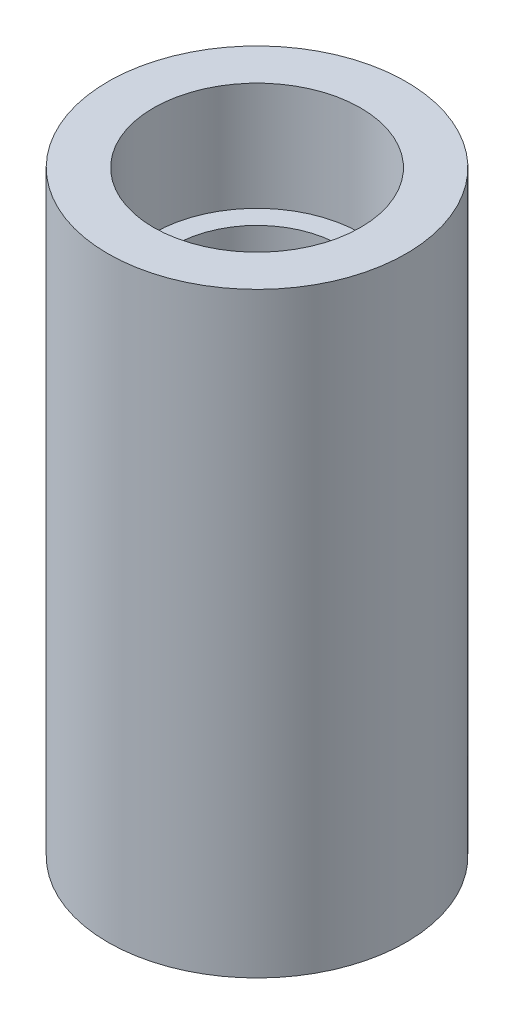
ISO-10303-21;
HEADER;
FILE_DESCRIPTION(('STEP AP214'),'2;1');
FILE_NAME('part.step','',(''),(''),'','','');
FILE_SCHEMA(('AUTOMOTIVE_DESIGN { 1 0 10303 214 1 1 1 1 }'));
ENDSEC;
DATA;
#1=APPLICATION_CONTEXT('core data for automotive mechanical design processes');
#2=APPLICATION_PROTOCOL_DEFINITION('international standard','automotive_design',2000,#1);
#3=PRODUCT_CONTEXT('',#1,'mechanical');
#4=PRODUCT('Part','Part','',(#3));
#5=PRODUCT_RELATED_PRODUCT_CATEGORY('part','',(#4));
#6=PRODUCT_DEFINITION_FORMATION('','',#4);
#7=PRODUCT_DEFINITION_CONTEXT('part definition',#1,'design');
#8=PRODUCT_DEFINITION('design','',#6,#7);
#9=PRODUCT_DEFINITION_SHAPE('','',#8);
#10=(LENGTH_UNIT() NAMED_UNIT(*) SI_UNIT(.MILLI.,.METRE.));
#11=(NAMED_UNIT(*) PLANE_ANGLE_UNIT() SI_UNIT($,.RADIAN.));
#12=(NAMED_UNIT(*) SI_UNIT($,.STERADIAN.) SOLID_ANGLE_UNIT());
#13=UNCERTAINTY_MEASURE_WITH_UNIT(LENGTH_MEASURE(1.E-05),#10,'distance_accuracy_value','');
#14=(GEOMETRIC_REPRESENTATION_CONTEXT(3) GLOBAL_UNCERTAINTY_ASSIGNED_CONTEXT((#13)) GLOBAL_UNIT_ASSIGNED_CONTEXT((#10,
#11,#12)) REPRESENTATION_CONTEXT('',''));
#15=CARTESIAN_POINT('',(0.,0.,0.));
#16=DIRECTION('',(0.,0.,1.));
#17=DIRECTION('',(1.,0.,0.));
#18=AXIS2_PLACEMENT_3D('',#15,#16,#17);
#19=CARTESIAN_POINT('',(0.,27.94,0.));
#20=DIRECTION('',(0.,-1.,0.));
#21=DIRECTION('',(0.,0.,-1.));
#22=AXIS2_PLACEMENT_3D('',#19,#20,#21);
#23=CYLINDRICAL_SURFACE('',#22,6.985);
#24=CARTESIAN_POINT('',(0.,27.94,0.));
#25=DIRECTION('',(0.,1.,0.));
#26=DIRECTION('',(0.,0.,1.));
#27=AXIS2_PLACEMENT_3D('',#24,#25,#26);
#28=CIRCLE('',#27,6.985);
#29=CARTESIAN_POINT('',(0.,27.94,6.985));
#30=VERTEX_POINT('',#29);
#31=EDGE_CURVE('E10',#30,#30,#28,.T.);
#32=ORIENTED_EDGE('',*,*,#31,.F.);
#33=EDGE_LOOP('',(#32));
#34=FACE_BOUND('',#33,.T.);
#35=CARTESIAN_POINT('',(0.,0.,0.));
#36=DIRECTION('',(0.,1.,0.));
#37=DIRECTION('',(0.,0.,1.));
#38=AXIS2_PLACEMENT_3D('',#35,#36,#37);
#39=CIRCLE('',#38,6.985);
#40=CARTESIAN_POINT('',(0.,0.,6.985));
#41=VERTEX_POINT('',#40);
#42=EDGE_CURVE('E33',#41,#41,#39,.T.);
#43=ORIENTED_EDGE('',*,*,#42,.T.);
#44=EDGE_LOOP('',(#43));
#45=FACE_BOUND('',#44,.T.);
#46=ADVANCED_FACE('F30',(#34,#45),#23,.T.);
#47=CARTESIAN_POINT('',(0.,27.94,0.));
#48=DIRECTION('',(0.,1.,0.));
#49=DIRECTION('',(0.,0.,1.));
#50=AXIS2_PLACEMENT_3D('',#47,#48,#49);
#51=PLANE('',#50);
#52=CARTESIAN_POINT('',(0.,27.94,0.));
#53=DIRECTION('',(0.,1.,0.));
#54=DIRECTION('',(0.,0.,1.));
#55=AXIS2_PLACEMENT_3D('',#52,#53,#54);
#56=CIRCLE('',#55,4.8514);
#57=CARTESIAN_POINT('',(0.,27.94,4.8514));
#58=VERTEX_POINT('',#57);
#59=EDGE_CURVE('E42',#58,#58,#56,.T.);
#60=ORIENTED_EDGE('',*,*,#59,.F.);
#61=EDGE_LOOP('',(#60));
#62=FACE_BOUND('',#61,.T.);
#63=ORIENTED_EDGE('',*,*,#31,.T.);
#64=EDGE_LOOP('',(#63));
#65=FACE_BOUND('',#64,.T.);
#66=ADVANCED_FACE('F73',(#62,#65),#51,.T.);
#67=CARTESIAN_POINT('',(0.,0.,0.));
#68=DIRECTION('',(0.,1.,0.));
#69=DIRECTION('',(0.,0.,1.));
#70=AXIS2_PLACEMENT_3D('',#67,#68,#69);
#71=PLANE('',#70);
#72=CARTESIAN_POINT('',(0.,0.,0.));
#73=DIRECTION('',(0.,-1.,0.));
#74=DIRECTION('',(0.,0.,-1.));
#75=AXIS2_PLACEMENT_3D('',#72,#73,#74);
#76=CIRCLE('',#75,4.7625);
#77=CARTESIAN_POINT('',(0.,0.,-4.7625));
#78=VERTEX_POINT('',#77);
#79=EDGE_CURVE('E54',#78,#78,#76,.T.);
#80=ORIENTED_EDGE('',*,*,#79,.F.);
#81=EDGE_LOOP('',(#80));
#82=FACE_BOUND('',#81,.T.);
#83=ORIENTED_EDGE('',*,*,#42,.F.);
#84=EDGE_LOOP('',(#83));
#85=FACE_BOUND('',#84,.T.);
#86=ADVANCED_FACE('F69',(#82,#85),#71,.F.);
#87=CARTESIAN_POINT('',(0.,22.86,0.));
#88=DIRECTION('',(0.,1.,0.));
#89=DIRECTION('',(0.,0.,1.));
#90=AXIS2_PLACEMENT_3D('',#87,#88,#89);
#91=CYLINDRICAL_SURFACE('',#90,4.8514);
#92=CARTESIAN_POINT('',(0.,22.86,0.));
#93=DIRECTION('',(0.,1.,0.));
#94=DIRECTION('',(0.,0.,1.));
#95=AXIS2_PLACEMENT_3D('',#92,#93,#94);
#96=CIRCLE('',#95,4.8514);
#97=CARTESIAN_POINT('',(0.,22.86,4.8514));
#98=VERTEX_POINT('',#97);
#99=EDGE_CURVE('E40',#98,#98,#96,.T.);
#100=ORIENTED_EDGE('',*,*,#99,.F.);
#101=EDGE_LOOP('',(#100));
#102=FACE_BOUND('',#101,.T.);
#103=ORIENTED_EDGE('',*,*,#59,.T.);
#104=EDGE_LOOP('',(#103));
#105=FACE_BOUND('',#104,.T.);
#106=ADVANCED_FACE('F72',(#102,#105),#91,.F.);
#107=CARTESIAN_POINT('',(0.,22.86,0.));
#108=DIRECTION('',(0.,1.,0.));
#109=DIRECTION('',(0.,0.,1.));
#110=AXIS2_PLACEMENT_3D('',#107,#108,#109);
#111=PLANE('',#110);
#112=CARTESIAN_POINT('',(0.,22.86,0.));
#113=DIRECTION('',(0.,1.,0.));
#114=DIRECTION('',(0.,0.,1.));
#115=AXIS2_PLACEMENT_3D('',#112,#113,#114);
#116=CIRCLE('',#115,3.8735);
#117=CARTESIAN_POINT('',(0.,22.86,3.8735));
#118=VERTEX_POINT('',#117);
#119=EDGE_CURVE('E45',#118,#118,#116,.T.);
#120=ORIENTED_EDGE('',*,*,#119,.F.);
#121=EDGE_LOOP('',(#120));
#122=FACE_BOUND('',#121,.T.);
#123=ORIENTED_EDGE('',*,*,#99,.T.);
#124=EDGE_LOOP('',(#123));
#125=FACE_BOUND('',#124,.T.);
#126=ADVANCED_FACE('F89',(#122,#125),#111,.T.);
#127=CARTESIAN_POINT('',(0.,20.32,0.));
#128=DIRECTION('',(0.,1.,0.));
#129=DIRECTION('',(0.,0.,1.));
#130=AXIS2_PLACEMENT_3D('',#127,#128,#129);
#131=CYLINDRICAL_SURFACE('',#130,3.8735);
#132=CARTESIAN_POINT('',(0.,20.32,0.));
#133=DIRECTION('',(0.,-1.,0.));
#134=DIRECTION('',(0.,0.,-1.));
#135=AXIS2_PLACEMENT_3D('',#132,#133,#134);
#136=CIRCLE('',#135,3.8735);
#137=CARTESIAN_POINT('',(0.,20.32,-3.8735));
#138=VERTEX_POINT('',#137);
#139=EDGE_CURVE('E50',#138,#138,#136,.F.);
#140=ORIENTED_EDGE('',*,*,#139,.F.);
#141=EDGE_LOOP('',(#140));
#142=FACE_BOUND('',#141,.T.);
#143=ORIENTED_EDGE('',*,*,#119,.T.);
#144=EDGE_LOOP('',(#143));
#145=FACE_BOUND('',#144,.T.);
#146=ADVANCED_FACE('F93',(#142,#145),#131,.F.);
#147=CARTESIAN_POINT('',(0.,20.32,0.));
#148=DIRECTION('',(0.,-1.,0.));
#149=DIRECTION('',(0.,0.,-1.));
#150=AXIS2_PLACEMENT_3D('',#147,#148,#149);
#151=PLANE('',#150);
#152=CARTESIAN_POINT('',(0.,20.32,0.));
#153=DIRECTION('',(0.,-1.,0.));
#154=DIRECTION('',(0.,0.,-1.));
#155=AXIS2_PLACEMENT_3D('',#152,#153,#154);
#156=CIRCLE('',#155,4.7625);
#157=CARTESIAN_POINT('',(0.,20.32,-4.7625));
#158=VERTEX_POINT('',#157);
#159=EDGE_CURVE('E53',#158,#158,#156,.T.);
#160=ORIENTED_EDGE('',*,*,#159,.T.);
#161=EDGE_LOOP('',(#160));
#162=FACE_BOUND('',#161,.T.);
#163=ORIENTED_EDGE('',*,*,#139,.T.);
#164=EDGE_LOOP('',(#163));
#165=FACE_BOUND('',#164,.T.);
#166=ADVANCED_FACE('F60',(#162,#165),#151,.T.);
#167=CARTESIAN_POINT('',(0.,20.32,0.));
#168=DIRECTION('',(0.,-1.,0.));
#169=DIRECTION('',(0.,0.,-1.));
#170=AXIS2_PLACEMENT_3D('',#167,#168,#169);
#171=CYLINDRICAL_SURFACE('',#170,4.7625);
#172=ORIENTED_EDGE('',*,*,#159,.F.);
#173=EDGE_LOOP('',(#172));
#174=FACE_BOUND('',#173,.T.);
#175=ORIENTED_EDGE('',*,*,#79,.T.);
#176=EDGE_LOOP('',(#175));
#177=FACE_BOUND('',#176,.T.);
#178=ADVANCED_FACE('F63',(#174,#177),#171,.F.);
#179=CLOSED_SHELL('',(#46,#66,#86,#106,#126,#146,#166,#178));
#180=MANIFOLD_SOLID_BREP('B2',#179);
#181=ADVANCED_BREP_SHAPE_REPRESENTATION('',(#18,#180),#14);
#182=SHAPE_DEFINITION_REPRESENTATION(#9,#181);
ENDSEC;
END-ISO-10303-21;
